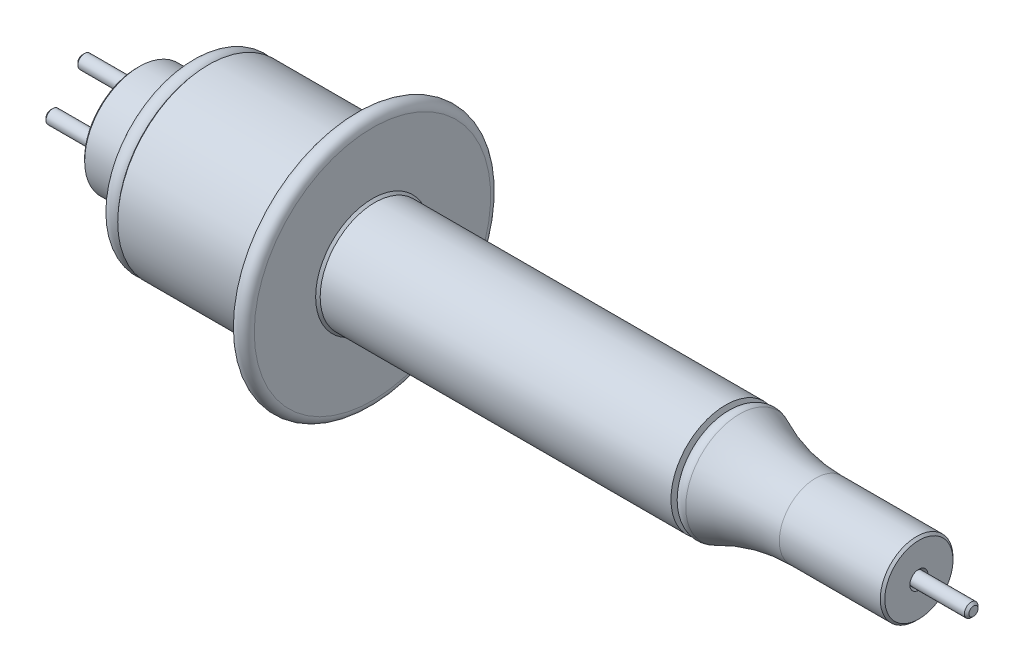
from build123d import *

# Parameters (mm, degrees)
CHAMFER_1_SIZE      = 0.25
SKETCH_2_R          = 0.75
EXTRUDE_1_DEPTH     = 12
SKETCH_3_R          = 0.75
CUT_EXTRUDE_1_DEPTH = 6
CHAMFER_2_SIZE      = 0.25
CHAMFER_3_SIZE      = 0.25
SKETCH_4_R          = 0.75
EXTRUDE_2_DEPTH     = 12
EXTRUDE_2_2_DEPTH   = 12
EXTRUDE_2_3_DEPTH   = 12
EXTRUDE_2_4_DEPTH   = 12
CHAMFER_4_SIZE      = 0.25
CHAMFER_5_SIZE      = 0.25
CHAMFER_6_SIZE      = 0.25
CHAMFER_7_SIZE      = 0.25


with BuildPart() as part:
    # Sketch 1 → Revolve 1 (revolve)
    with BuildSketch(Plane.XY, mode=Mode.PRIVATE) as revolve_1_sk:
        with BuildLine():
            Line((0, 0), (80, 0))
            Line((80, 0), (80, 0.75))
            Line((80, 0.75), (86, 0.75))
            Line((86, 0.75), (86, 4))
            Line((86, 4), (74.65, 4))
            ThreePointArc((74.65, 4), (70.349185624, 4.481508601), (66.261335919, 5.902191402))
            ThreePointArc((66.261335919, 5.902191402), (65.491457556, 5.940951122), (64.922746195, 5.420583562))
            Line((64.922746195, 5.420583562), (64.73, 6))
            Line((64.73, 6), (25.904093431, 6))
            Line((25.904093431, 6), (25.904093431, 13))
            ThreePointArc((25.904093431, 13), (24.972372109, 13.952273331), (24, 13.041547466))
            Line((24, 13.041547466), (23.846768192, 9.531962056))
            ThreePointArc((23.846768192, 9.531962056), (23.141530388, 9.989933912), (22.336216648, 9.747924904))
            Line((22.336216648, 9.747924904), (22.1125, 10))
            Line((22.1125, 10), (7.8875, 10))
            Line((7.8875, 10), (7.663783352, 9.747924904))
            ThreePointArc((7.663783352, 9.747924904), (6.589989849, 9.912080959), (6, 9))
            Line((6, 9), (6, 6))
            Line((6, 6), (0, 6))
            Line((0, 6), (0, 0))
        make_face()
    revolve(revolve_1_sk.sketch.rotate(Axis((0, 0, 0), (1, 0, 0)), 90), axis=Axis((0, 0, 0), (1, 0, 0)))

    # Chamfer 1
    chamfer_1_edges = [part.edges().sort_by_distance(p)[0] for p in [
        (0, 0, -6),
        (25.904093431, 0, -6),
        (86, 0, -4),
        (86, 0, -0.75),
        (80, 0, -0.75),
    ]]
    chamfer(chamfer_1_edges, length=CHAMFER_1_SIZE)

    # Sketch 3 → Cut-Extrude 1 (cut)
    with BuildSketch(Plane.ZY):
        with Locations((0, 3.5)):
            Circle(SKETCH_3_R)
        with Locations((3.5, 0)):
            Circle(SKETCH_3_R)
        with Locations((0, -3.5)):
            Circle(SKETCH_3_R)
        with Locations((-3.5, 0)):
            Circle(SKETCH_3_R)
    extrude(amount=-CUT_EXTRUDE_1_DEPTH, mode=Mode.SUBTRACT)

    # Chamfer 3
    chamfer_3_edges = [part.edges().sort_by_distance(p)[0] for p in [
        (6, 3.5, -0.75),
        (0, 3.5, -0.75),
        (6, 0, 2.75),
        (0, 0, 2.75),
        (6, -3.5, -0.75),
        (0, -3.5, -0.75),
        (6, 0, -4.25),
        (0, 0, -4.25),
    ]]
    chamfer(chamfer_3_edges, length=CHAMFER_3_SIZE)


with BuildPart() as body_2:
    # Sketch 2 → Extrude 1 (new body)
    with BuildSketch(Plane(origin=(80, 0, 0), x_dir=(0, 0, -1), z_dir=(1, 0, 0))):
        Circle(SKETCH_2_R)
    extrude(amount=EXTRUDE_1_DEPTH)

    # Chamfer 2
    chamfer_2_edges = [body_2.edges().sort_by_distance(p)[0] for p in [
        (80, 0, 0.75),
        (92, 0, 0.75),
    ]]
    chamfer(chamfer_2_edges, length=CHAMFER_2_SIZE)


with BuildPart() as body_3:
    # Sketch 4 → Extrude 2 (new body)
    with BuildSketch(Plane.ZY.offset(-6)):
        with Locations((-3.5, 0)):
            Circle(SKETCH_4_R)
    extrude(amount=EXTRUDE_2_DEPTH)

    # Chamfer 5
    chamfer_5_edges = [body_3.edges().sort_by_distance(p)[0] for p in [
        (6, 0, -4.25),
        (-6, 0, -4.25),
    ]]
    chamfer(chamfer_5_edges, length=CHAMFER_5_SIZE)


with BuildPart() as body_4:
    # Sketch 4 → Extrude 2 2 (new body)
    with BuildSketch(Plane.ZY.offset(-6)):
        with Locations((0, -3.5)):
            Circle(SKETCH_4_R)
    extrude(amount=EXTRUDE_2_2_DEPTH)

    # Chamfer 6
    chamfer_6_edges = [body_4.edges().sort_by_distance(p)[0] for p in [
        (6, -3.5, -0.75),
        (-6, -3.5, -0.75),
    ]]
    chamfer(chamfer_6_edges, length=CHAMFER_6_SIZE)


with BuildPart() as body_5:
    # Sketch 4 → Extrude 2 3 (new body)
    with BuildSketch(Plane.ZY.offset(-6)):
        with Locations((3.5, 0)):
            Circle(SKETCH_4_R)
    extrude(amount=EXTRUDE_2_3_DEPTH)

    # Chamfer 7
    chamfer_7_edges = [body_5.edges().sort_by_distance(p)[0] for p in [
        (6, 0, 2.75),
        (-6, 0, 2.75),
    ]]
    chamfer(chamfer_7_edges, length=CHAMFER_7_SIZE)


with BuildPart() as body_6:
    # Sketch 4 → Extrude 2 4 (new body)
    with BuildSketch(Plane.ZY.offset(-6)):
        with Locations((0, 3.5)):
            Circle(SKETCH_4_R)
    extrude(amount=EXTRUDE_2_4_DEPTH)

    # Chamfer 4
    chamfer_4_edges = [body_6.edges().sort_by_distance(p)[0] for p in [
        (6, 3.5, -0.75),
        (-6, 3.5, -0.75),
    ]]
    chamfer(chamfer_4_edges, length=CHAMFER_4_SIZE)


solid = Compound([part.part, body_2.part, body_3.part, body_4.part, body_5.part, body_6.part])
